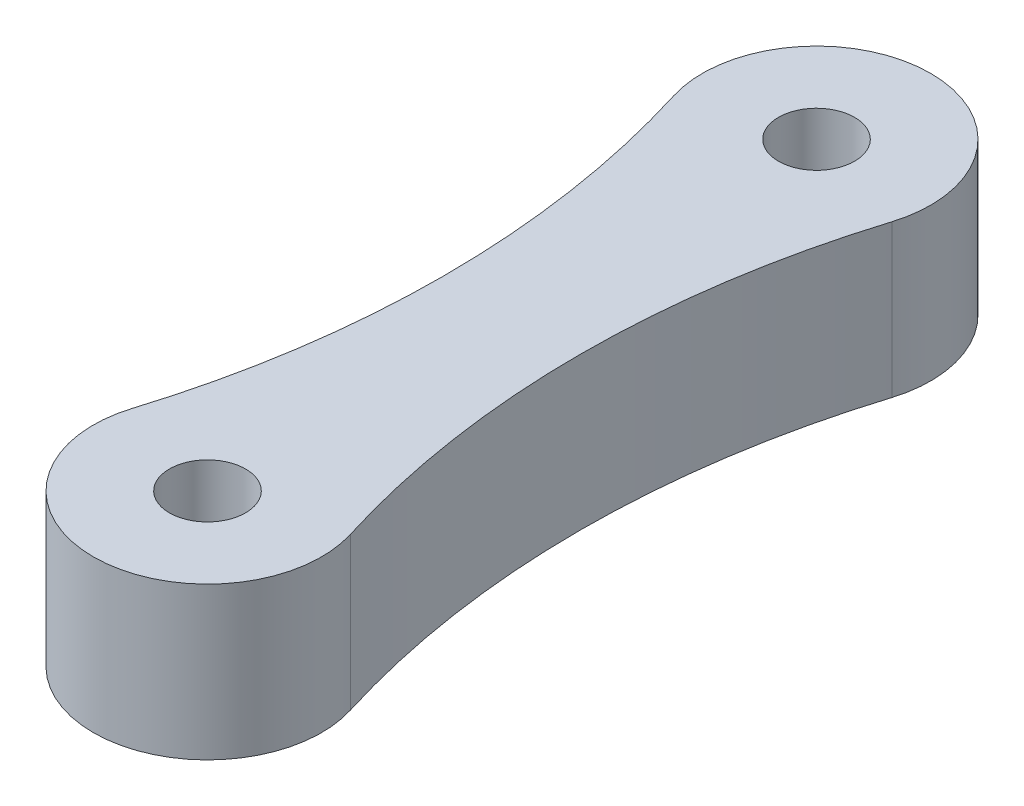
from build123d import *

# Parameters (mm, degrees)
SKETCH1_R           = 2.5
BOSS_EXTRUDE1_DEPTH = 5


with BuildPart() as part:
    # Sketch1 → Boss-Extrude1 (new, symmetric)
    with BuildSketch(Plane(origin=(0, 0, 0), x_dir=(1, 0, 0), z_dir=(0, 1, 0))):
        with BuildLine():
            ThreePointArc((-7.5, 0), (0, -7.5), (7.5, 0))
            ThreePointArc((7.5, 0), (7.415327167, 1.123798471), (7.163220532, 2.222222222))
            ThreePointArc((7.163220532, 2.222222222), (4.468984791, 20), (7.163220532, 37.777777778))
            ThreePointArc((7.163220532, 37.777777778), (7.415327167, 38.876201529), (7.5, 40))
            ThreePointArc((7.5, 40), (0, 47.5), (-7.5, 40))
            ThreePointArc((-7.5, 40), (-7.415327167, 38.876201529), (-7.163220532, 37.777777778))
            ThreePointArc((-7.163220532, 37.777777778), (-4.468984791, 20), (-7.163220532, 2.222222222))
            ThreePointArc((-7.163220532, 2.222222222), (-7.415327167, 1.123798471), (-7.5, 0))
        make_face()
        with Locations(Location((0, 40, 0), (0, 0, 270))):
            Circle(SKETCH1_R, mode=Mode.SUBTRACT)
        with Locations(Location((0, 0, 0), (0, 0, 270))):
            Circle(SKETCH1_R, mode=Mode.SUBTRACT)
    extrude(amount=BOSS_EXTRUDE1_DEPTH, both=True)


solid = part.part
